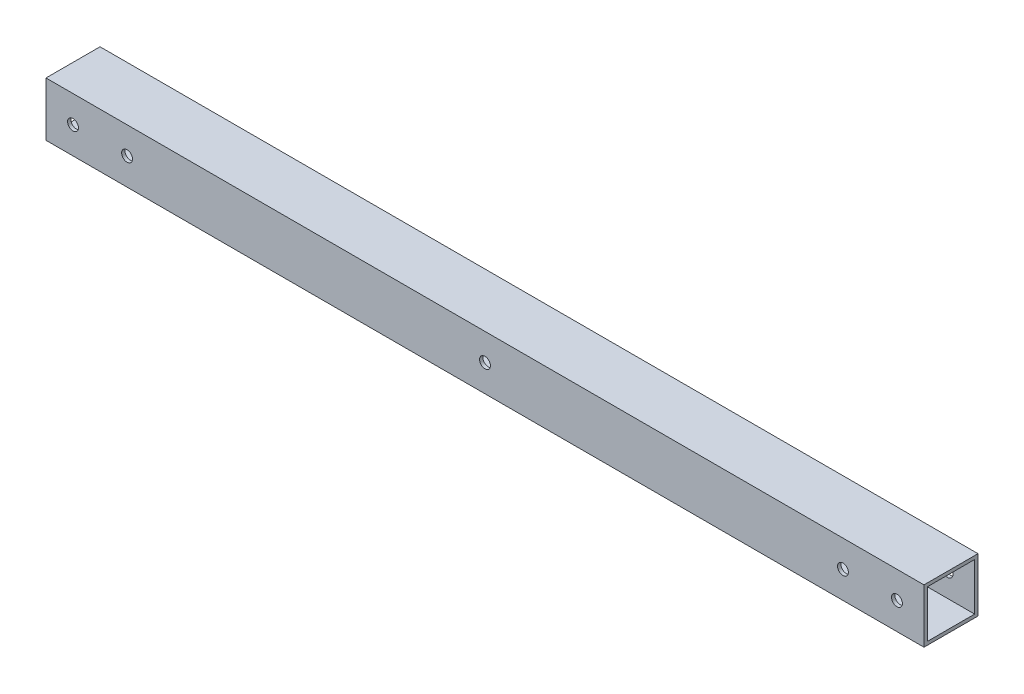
from build123d import *

# Parameters (mm, degrees)
SKETCH1_W                  = 25.4
SKETCH1_H                  = 25.4
SKETCH1_W_2                = 22.225
SKETCH1_H_2                = 22.225
BOSS_EXTRUDE1_DEPTH        = 412.75
F_7_0_201_DIAMETER_HOLE1_D = 5.1054


with BuildPart() as part:
    # Sketch1 → Boss-Extrude1 (new body)
    with BuildSketch(Plane(origin=(0, 0, 0), x_dir=(0, 0, -1), z_dir=(1, 0, 0))):
        Rectangle(SKETCH1_W, SKETCH1_H)
        Rectangle(SKETCH1_W_2, SKETCH1_H_2, mode=Mode.SUBTRACT)
    extrude(amount=BOSS_EXTRUDE1_DEPTH)

    # 7 _0.201_ Diameter Hole1 (through all)
    with Locations(Plane.XY.offset(12.7)):
        with Locations((400.05, 0), (374.65, 0), (12.7, 0), (38.1, 0), (206.375, 0)):
            Hole(F_7_0_201_DIAMETER_HOLE1_D / 2)


solid = part.part
